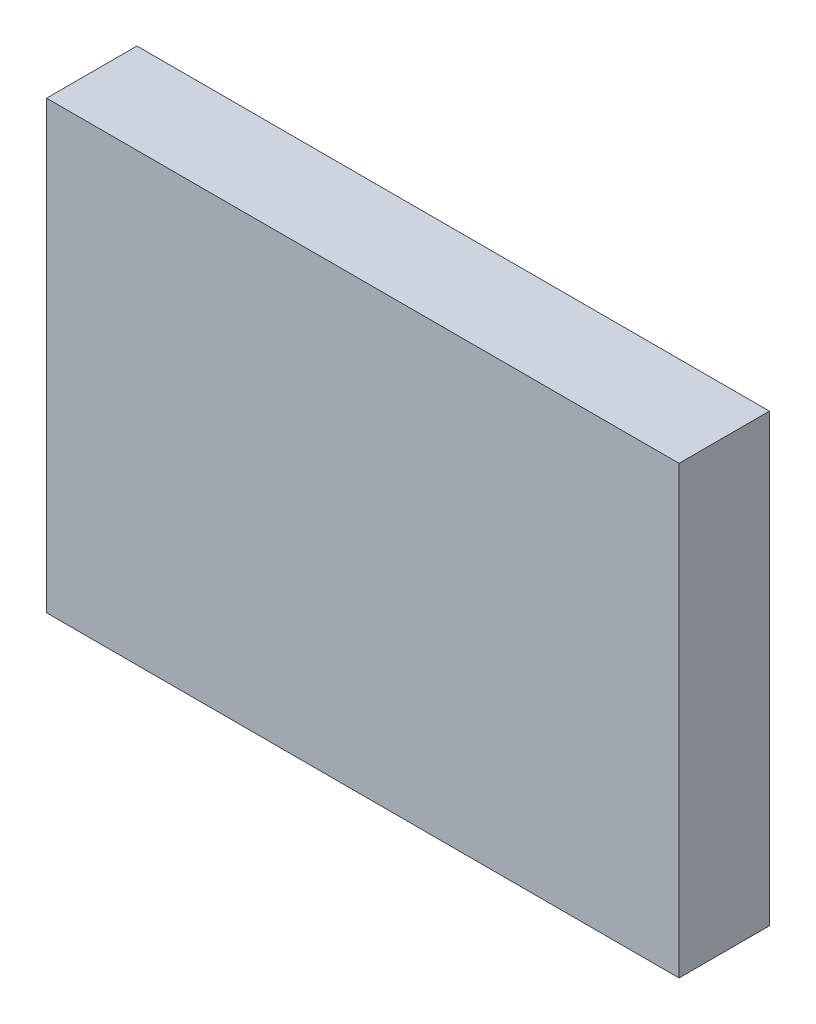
ISO-10303-21;
HEADER;
FILE_DESCRIPTION(('STEP AP214'),'2;1');
FILE_NAME('part.step','',(''),(''),'','','');
FILE_SCHEMA(('AUTOMOTIVE_DESIGN { 1 0 10303 214 1 1 1 1 }'));
ENDSEC;
DATA;
#1=APPLICATION_CONTEXT('core data for automotive mechanical design processes');
#2=APPLICATION_PROTOCOL_DEFINITION('international standard','automotive_design',2000,#1);
#3=PRODUCT_CONTEXT('',#1,'mechanical');
#4=PRODUCT('Part','Part','',(#3));
#5=PRODUCT_RELATED_PRODUCT_CATEGORY('part','',(#4));
#6=PRODUCT_DEFINITION_FORMATION('','',#4);
#7=PRODUCT_DEFINITION_CONTEXT('part definition',#1,'design');
#8=PRODUCT_DEFINITION('design','',#6,#7);
#9=PRODUCT_DEFINITION_SHAPE('','',#8);
#10=(LENGTH_UNIT() NAMED_UNIT(*) SI_UNIT(.MILLI.,.METRE.));
#11=(NAMED_UNIT(*) PLANE_ANGLE_UNIT() SI_UNIT($,.RADIAN.));
#12=(NAMED_UNIT(*) SI_UNIT($,.STERADIAN.) SOLID_ANGLE_UNIT());
#13=UNCERTAINTY_MEASURE_WITH_UNIT(LENGTH_MEASURE(1.E-05),#10,'distance_accuracy_value','');
#14=(GEOMETRIC_REPRESENTATION_CONTEXT(3) GLOBAL_UNCERTAINTY_ASSIGNED_CONTEXT((#13)) GLOBAL_UNIT_ASSIGNED_CONTEXT((#10,
#11,#12)) REPRESENTATION_CONTEXT('',''));
#15=CARTESIAN_POINT('',(0.,0.,0.));
#16=DIRECTION('',(0.,0.,1.));
#17=DIRECTION('',(1.,0.,0.));
#18=AXIS2_PLACEMENT_3D('',#15,#16,#17);
#19=CARTESIAN_POINT('',(0.,0.,30.));
#20=DIRECTION('',(1.,0.,0.));
#21=DIRECTION('',(0.,0.,-1.));
#22=AXIS2_PLACEMENT_3D('',#19,#20,#21);
#23=PLANE('',#22);
#24=DIRECTION('',(0.,-1.,0.));
#25=VECTOR('',#24,1.);
#26=CARTESIAN_POINT('',(0.,0.,0.));
#27=LINE('',#26,#25);
#28=CARTESIAN_POINT('',(0.,148.,0.));
#29=VERTEX_POINT('',#28);
#30=CARTESIAN_POINT('',(0.,0.,0.));
#31=VERTEX_POINT('',#30);
#32=EDGE_CURVE('E94',#29,#31,#27,.T.);
#33=ORIENTED_EDGE('',*,*,#32,.T.);
#34=DIRECTION('',(0.,0.,-1.));
#35=VECTOR('',#34,1.);
#36=CARTESIAN_POINT('',(0.,0.,30.));
#37=LINE('',#36,#35);
#38=CARTESIAN_POINT('',(0.,0.,30.));
#39=VERTEX_POINT('',#38);
#40=EDGE_CURVE('E11',#39,#31,#37,.T.);
#41=ORIENTED_EDGE('',*,*,#40,.F.);
#42=DIRECTION('',(0.,-1.,0.));
#43=VECTOR('',#42,1.);
#44=CARTESIAN_POINT('',(0.,0.,30.));
#45=LINE('',#44,#43);
#46=CARTESIAN_POINT('',(0.,148.,30.));
#47=VERTEX_POINT('',#46);
#48=EDGE_CURVE('E82',#47,#39,#45,.T.);
#49=ORIENTED_EDGE('',*,*,#48,.F.);
#50=DIRECTION('',(0.,0.,-1.));
#51=VECTOR('',#50,1.);
#52=CARTESIAN_POINT('',(0.,148.,30.));
#53=LINE('',#52,#51);
#54=EDGE_CURVE('E90',#47,#29,#53,.T.);
#55=ORIENTED_EDGE('',*,*,#54,.T.);
#56=EDGE_LOOP('',(#33,#41,#49,#55));
#57=FACE_BOUND('',#56,.T.);
#58=ADVANCED_FACE('F31',(#57),#23,.F.);
#59=CARTESIAN_POINT('',(0.,0.,30.));
#60=DIRECTION('',(0.,1.,0.));
#61=DIRECTION('',(0.,0.,1.));
#62=AXIS2_PLACEMENT_3D('',#59,#60,#61);
#63=PLANE('',#62);
#64=DIRECTION('',(1.,0.,0.));
#65=VECTOR('',#64,1.);
#66=CARTESIAN_POINT('',(0.,0.,0.));
#67=LINE('',#66,#65);
#68=CARTESIAN_POINT('',(210.,0.,0.));
#69=VERTEX_POINT('',#68);
#70=EDGE_CURVE('E86',#31,#69,#67,.T.);
#71=ORIENTED_EDGE('',*,*,#70,.T.);
#72=DIRECTION('',(0.,0.,-1.));
#73=VECTOR('',#72,1.);
#74=CARTESIAN_POINT('',(210.,0.,30.));
#75=LINE('',#74,#73);
#76=CARTESIAN_POINT('',(210.,0.,30.));
#77=VERTEX_POINT('',#76);
#78=EDGE_CURVE('E39',#77,#69,#75,.T.);
#79=ORIENTED_EDGE('',*,*,#78,.F.);
#80=DIRECTION('',(1.,0.,0.));
#81=VECTOR('',#80,1.);
#82=CARTESIAN_POINT('',(0.,0.,30.));
#83=LINE('',#82,#81);
#84=EDGE_CURVE('E77',#39,#77,#83,.T.);
#85=ORIENTED_EDGE('',*,*,#84,.F.);
#86=ORIENTED_EDGE('',*,*,#40,.T.);
#87=EDGE_LOOP('',(#71,#79,#85,#86));
#88=FACE_BOUND('',#87,.T.);
#89=ADVANCED_FACE('F85',(#88),#63,.F.);
#90=CARTESIAN_POINT('',(210.,0.,30.));
#91=DIRECTION('',(-1.,0.,0.));
#92=DIRECTION('',(0.,0.,1.));
#93=AXIS2_PLACEMENT_3D('',#90,#91,#92);
#94=PLANE('',#93);
#95=DIRECTION('',(0.,1.,0.));
#96=VECTOR('',#95,1.);
#97=CARTESIAN_POINT('',(210.,0.,0.));
#98=LINE('',#97,#96);
#99=CARTESIAN_POINT('',(210.,148.,0.));
#100=VERTEX_POINT('',#99);
#101=EDGE_CURVE('E64',#69,#100,#98,.T.);
#102=ORIENTED_EDGE('',*,*,#101,.T.);
#103=DIRECTION('',(0.,0.,-1.));
#104=VECTOR('',#103,1.);
#105=CARTESIAN_POINT('',(210.,148.,30.));
#106=LINE('',#105,#104);
#107=CARTESIAN_POINT('',(210.,148.,30.));
#108=VERTEX_POINT('',#107);
#109=EDGE_CURVE('E87',#108,#100,#106,.T.);
#110=ORIENTED_EDGE('',*,*,#109,.F.);
#111=DIRECTION('',(0.,1.,0.));
#112=VECTOR('',#111,1.);
#113=CARTESIAN_POINT('',(210.,0.,30.));
#114=LINE('',#113,#112);
#115=EDGE_CURVE('E80',#77,#108,#114,.T.);
#116=ORIENTED_EDGE('',*,*,#115,.F.);
#117=ORIENTED_EDGE('',*,*,#78,.T.);
#118=EDGE_LOOP('',(#102,#110,#116,#117));
#119=FACE_BOUND('',#118,.T.);
#120=ADVANCED_FACE('F88',(#119),#94,.F.);
#121=CARTESIAN_POINT('',(0.,148.,30.));
#122=DIRECTION('',(0.,-1.,0.));
#123=DIRECTION('',(0.,0.,-1.));
#124=AXIS2_PLACEMENT_3D('',#121,#122,#123);
#125=PLANE('',#124);
#126=DIRECTION('',(-1.,0.,0.));
#127=VECTOR('',#126,1.);
#128=CARTESIAN_POINT('',(0.,148.,0.));
#129=LINE('',#128,#127);
#130=EDGE_CURVE('E70',#100,#29,#129,.T.);
#131=ORIENTED_EDGE('',*,*,#130,.T.);
#132=ORIENTED_EDGE('',*,*,#54,.F.);
#133=DIRECTION('',(-1.,0.,0.));
#134=VECTOR('',#133,1.);
#135=CARTESIAN_POINT('',(0.,148.,30.));
#136=LINE('',#135,#134);
#137=EDGE_CURVE('E47',#108,#47,#136,.T.);
#138=ORIENTED_EDGE('',*,*,#137,.F.);
#139=ORIENTED_EDGE('',*,*,#109,.T.);
#140=EDGE_LOOP('',(#131,#132,#138,#139));
#141=FACE_BOUND('',#140,.T.);
#142=ADVANCED_FACE('F101',(#141),#125,.F.);
#143=CARTESIAN_POINT('',(0.,148.,30.));
#144=DIRECTION('',(0.,0.,-1.));
#145=DIRECTION('',(-1.,0.,0.));
#146=AXIS2_PLACEMENT_3D('',#143,#144,#145);
#147=PLANE('',#146);
#148=ORIENTED_EDGE('',*,*,#48,.T.);
#149=ORIENTED_EDGE('',*,*,#84,.T.);
#150=ORIENTED_EDGE('',*,*,#115,.T.);
#151=ORIENTED_EDGE('',*,*,#137,.T.);
#152=EDGE_LOOP('',(#148,#149,#150,#151));
#153=FACE_BOUND('',#152,.T.);
#154=ADVANCED_FACE('F78',(#153),#147,.F.);
#155=CARTESIAN_POINT('',(0.,148.,0.));
#156=DIRECTION('',(0.,0.,-1.));
#157=DIRECTION('',(-1.,0.,0.));
#158=AXIS2_PLACEMENT_3D('',#155,#156,#157);
#159=PLANE('',#158);
#160=ORIENTED_EDGE('',*,*,#32,.F.);
#161=ORIENTED_EDGE('',*,*,#130,.F.);
#162=ORIENTED_EDGE('',*,*,#101,.F.);
#163=ORIENTED_EDGE('',*,*,#70,.F.);
#164=EDGE_LOOP('',(#160,#161,#162,#163));
#165=FACE_BOUND('',#164,.T.);
#166=ADVANCED_FACE('F104',(#165),#159,.T.);
#167=CLOSED_SHELL('',(#58,#89,#120,#142,#154,#166));
#168=MANIFOLD_SOLID_BREP('B2',#167);
#169=ADVANCED_BREP_SHAPE_REPRESENTATION('',(#18,#168),#14);
#170=SHAPE_DEFINITION_REPRESENTATION(#9,#169);
ENDSEC;
END-ISO-10303-21;
